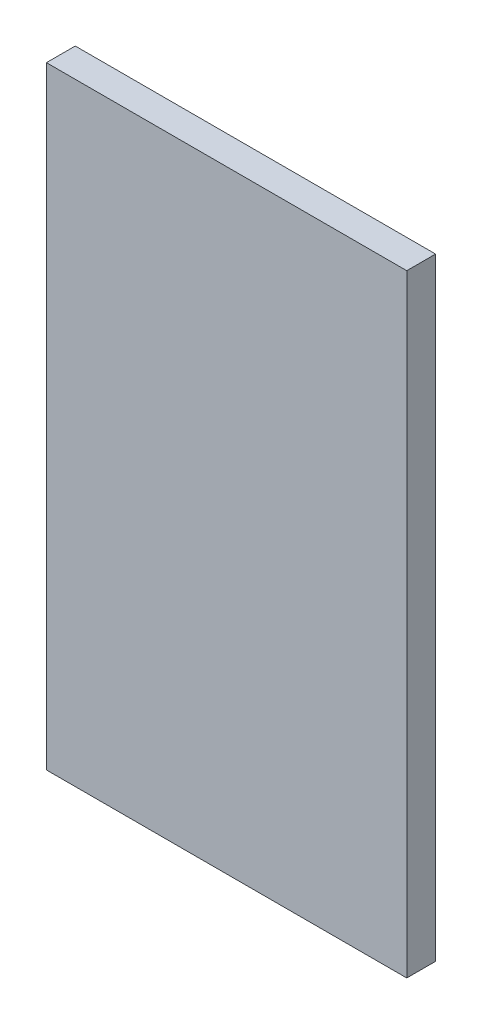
ISO-10303-21;
HEADER;
FILE_DESCRIPTION(('STEP AP214'),'2;1');
FILE_NAME('part.step','',(''),(''),'','','');
FILE_SCHEMA(('AUTOMOTIVE_DESIGN { 1 0 10303 214 1 1 1 1 }'));
ENDSEC;
DATA;
#1=APPLICATION_CONTEXT('core data for automotive mechanical design processes');
#2=APPLICATION_PROTOCOL_DEFINITION('international standard','automotive_design',2000,#1);
#3=PRODUCT_CONTEXT('',#1,'mechanical');
#4=PRODUCT('Part','Part','',(#3));
#5=PRODUCT_RELATED_PRODUCT_CATEGORY('part','',(#4));
#6=PRODUCT_DEFINITION_FORMATION('','',#4);
#7=PRODUCT_DEFINITION_CONTEXT('part definition',#1,'design');
#8=PRODUCT_DEFINITION('design','',#6,#7);
#9=PRODUCT_DEFINITION_SHAPE('','',#8);
#10=(LENGTH_UNIT() NAMED_UNIT(*) SI_UNIT(.MILLI.,.METRE.));
#11=(NAMED_UNIT(*) PLANE_ANGLE_UNIT() SI_UNIT($,.RADIAN.));
#12=(NAMED_UNIT(*) SI_UNIT($,.STERADIAN.) SOLID_ANGLE_UNIT());
#13=UNCERTAINTY_MEASURE_WITH_UNIT(LENGTH_MEASURE(1.E-05),#10,'distance_accuracy_value','');
#14=(GEOMETRIC_REPRESENTATION_CONTEXT(3) GLOBAL_UNCERTAINTY_ASSIGNED_CONTEXT((#13)) GLOBAL_UNIT_ASSIGNED_CONTEXT((#10,
#11,#12)) REPRESENTATION_CONTEXT('',''));
#15=CARTESIAN_POINT('',(0.,0.,0.));
#16=DIRECTION('',(0.,0.,1.));
#17=DIRECTION('',(1.,0.,0.));
#18=AXIS2_PLACEMENT_3D('',#15,#16,#17);
#19=CARTESIAN_POINT('',(20.,0.,1.59999999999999));
#20=DIRECTION('',(0.,1.,0.));
#21=DIRECTION('',(0.,0.,1.));
#22=AXIS2_PLACEMENT_3D('',#19,#20,#21);
#23=PLANE('',#22);
#24=DIRECTION('',(0.,0.,-1.));
#25=VECTOR('',#24,1.);
#26=CARTESIAN_POINT('',(0.,0.,1.59999999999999));
#27=LINE('',#26,#25);
#28=CARTESIAN_POINT('',(0.,0.,1.59999999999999));
#29=VERTEX_POINT('',#28);
#30=CARTESIAN_POINT('',(0.,0.,0.));
#31=VERTEX_POINT('',#30);
#32=EDGE_CURVE('E115',#29,#31,#27,.T.);
#33=ORIENTED_EDGE('',*,*,#32,.T.);
#34=DIRECTION('',(-1.,0.,0.));
#35=VECTOR('',#34,1.);
#36=CARTESIAN_POINT('',(20.,0.,0.));
#37=LINE('',#36,#35);
#38=CARTESIAN_POINT('',(20.,0.,0.));
#39=VERTEX_POINT('',#38);
#40=EDGE_CURVE('E11',#39,#31,#37,.T.);
#41=ORIENTED_EDGE('',*,*,#40,.F.);
#42=DIRECTION('',(0.,0.,-1.));
#43=VECTOR('',#42,1.);
#44=CARTESIAN_POINT('',(20.,0.,1.59999999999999));
#45=LINE('',#44,#43);
#46=CARTESIAN_POINT('',(20.,0.,1.59999999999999));
#47=VERTEX_POINT('',#46);
#48=EDGE_CURVE('E94',#47,#39,#45,.T.);
#49=ORIENTED_EDGE('',*,*,#48,.F.);
#50=DIRECTION('',(-1.,0.,0.));
#51=VECTOR('',#50,1.);
#52=CARTESIAN_POINT('',(20.,0.,1.59999999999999));
#53=LINE('',#52,#51);
#54=EDGE_CURVE('E106',#47,#29,#53,.T.);
#55=ORIENTED_EDGE('',*,*,#54,.T.);
#56=EDGE_LOOP('',(#33,#41,#49,#55));
#57=FACE_BOUND('',#56,.T.);
#58=ADVANCED_FACE('F43',(#57),#23,.F.);
#59=CARTESIAN_POINT('',(20.,0.,0.));
#60=DIRECTION('',(0.,0.,1.));
#61=DIRECTION('',(1.,0.,0.));
#62=AXIS2_PLACEMENT_3D('',#59,#60,#61);
#63=PLANE('',#62);
#64=DIRECTION('',(0.,1.,0.));
#65=VECTOR('',#64,1.);
#66=CARTESIAN_POINT('',(0.,0.,0.));
#67=LINE('',#66,#65);
#68=CARTESIAN_POINT('',(0.,34.,0.));
#69=VERTEX_POINT('',#68);
#70=EDGE_CURVE('E99',#31,#69,#67,.T.);
#71=ORIENTED_EDGE('',*,*,#70,.T.);
#72=DIRECTION('',(-1.,0.,0.));
#73=VECTOR('',#72,1.);
#74=CARTESIAN_POINT('',(20.,34.,0.));
#75=LINE('',#74,#73);
#76=CARTESIAN_POINT('',(20.,34.,0.));
#77=VERTEX_POINT('',#76);
#78=EDGE_CURVE('E55',#77,#69,#75,.T.);
#79=ORIENTED_EDGE('',*,*,#78,.F.);
#80=DIRECTION('',(0.,1.,0.));
#81=VECTOR('',#80,1.);
#82=CARTESIAN_POINT('',(20.,0.,0.));
#83=LINE('',#82,#81);
#84=EDGE_CURVE('E89',#39,#77,#83,.T.);
#85=ORIENTED_EDGE('',*,*,#84,.F.);
#86=ORIENTED_EDGE('',*,*,#40,.T.);
#87=EDGE_LOOP('',(#71,#79,#85,#86));
#88=FACE_BOUND('',#87,.T.);
#89=ADVANCED_FACE('F98',(#88),#63,.F.);
#90=CARTESIAN_POINT('',(20.,34.,0.));
#91=DIRECTION('',(0.,-1.,0.));
#92=DIRECTION('',(0.,0.,-1.));
#93=AXIS2_PLACEMENT_3D('',#90,#91,#92);
#94=PLANE('',#93);
#95=DIRECTION('',(0.,0.,1.));
#96=VECTOR('',#95,1.);
#97=CARTESIAN_POINT('',(0.,34.,0.));
#98=LINE('',#97,#96);
#99=CARTESIAN_POINT('',(0.,34.,1.59999999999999));
#100=VERTEX_POINT('',#99);
#101=EDGE_CURVE('E77',#69,#100,#98,.T.);
#102=ORIENTED_EDGE('',*,*,#101,.T.);
#103=DIRECTION('',(-1.,0.,0.));
#104=VECTOR('',#103,1.);
#105=CARTESIAN_POINT('',(20.,34.,1.59999999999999));
#106=LINE('',#105,#104);
#107=CARTESIAN_POINT('',(20.,34.,1.59999999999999));
#108=VERTEX_POINT('',#107);
#109=EDGE_CURVE('E105',#108,#100,#106,.T.);
#110=ORIENTED_EDGE('',*,*,#109,.F.);
#111=DIRECTION('',(0.,0.,1.));
#112=VECTOR('',#111,1.);
#113=CARTESIAN_POINT('',(20.,34.,0.));
#114=LINE('',#113,#112);
#115=EDGE_CURVE('E93',#77,#108,#114,.T.);
#116=ORIENTED_EDGE('',*,*,#115,.F.);
#117=ORIENTED_EDGE('',*,*,#78,.T.);
#118=EDGE_LOOP('',(#102,#110,#116,#117));
#119=FACE_BOUND('',#118,.T.);
#120=ADVANCED_FACE('F104',(#119),#94,.F.);
#121=CARTESIAN_POINT('',(20.,34.,1.59999999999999));
#122=DIRECTION('',(0.,0.,-1.));
#123=DIRECTION('',(-1.,0.,0.));
#124=AXIS2_PLACEMENT_3D('',#121,#122,#123);
#125=PLANE('',#124);
#126=DIRECTION('',(0.,-1.,0.));
#127=VECTOR('',#126,1.);
#128=CARTESIAN_POINT('',(0.,34.,1.59999999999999));
#129=LINE('',#128,#127);
#130=EDGE_CURVE('E81',#100,#29,#129,.T.);
#131=ORIENTED_EDGE('',*,*,#130,.T.);
#132=ORIENTED_EDGE('',*,*,#54,.F.);
#133=DIRECTION('',(0.,-1.,0.));
#134=VECTOR('',#133,1.);
#135=CARTESIAN_POINT('',(20.,34.,1.59999999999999));
#136=LINE('',#135,#134);
#137=EDGE_CURVE('E58',#108,#47,#136,.T.);
#138=ORIENTED_EDGE('',*,*,#137,.F.);
#139=ORIENTED_EDGE('',*,*,#109,.T.);
#140=EDGE_LOOP('',(#131,#132,#138,#139));
#141=FACE_BOUND('',#140,.T.);
#142=ADVANCED_FACE('F128',(#141),#125,.F.);
#143=CARTESIAN_POINT('',(20.,0.,0.));
#144=DIRECTION('',(1.,0.,0.));
#145=DIRECTION('',(0.,0.,-1.));
#146=AXIS2_PLACEMENT_3D('',#143,#144,#145);
#147=PLANE('',#146);
#148=ORIENTED_EDGE('',*,*,#48,.T.);
#149=ORIENTED_EDGE('',*,*,#84,.T.);
#150=ORIENTED_EDGE('',*,*,#115,.T.);
#151=ORIENTED_EDGE('',*,*,#137,.T.);
#152=EDGE_LOOP('',(#148,#149,#150,#151));
#153=FACE_BOUND('',#152,.T.);
#154=ADVANCED_FACE('F91',(#153),#147,.T.);
#155=CARTESIAN_POINT('',(0.,0.,0.));
#156=DIRECTION('',(1.,0.,0.));
#157=DIRECTION('',(0.,0.,-1.));
#158=AXIS2_PLACEMENT_3D('',#155,#156,#157);
#159=PLANE('',#158);
#160=ORIENTED_EDGE('',*,*,#32,.F.);
#161=ORIENTED_EDGE('',*,*,#130,.F.);
#162=ORIENTED_EDGE('',*,*,#101,.F.);
#163=ORIENTED_EDGE('',*,*,#70,.F.);
#164=EDGE_LOOP('',(#160,#161,#162,#163));
#165=FACE_BOUND('',#164,.T.);
#166=ADVANCED_FACE('F129',(#165),#159,.F.);
#167=CLOSED_SHELL('',(#58,#89,#120,#142,#154,#166));
#168=MANIFOLD_SOLID_BREP('B2',#167);
#169=ADVANCED_BREP_SHAPE_REPRESENTATION('',(#18,#168),#14);
#170=SHAPE_DEFINITION_REPRESENTATION(#9,#169);
ENDSEC;
END-ISO-10303-21;
